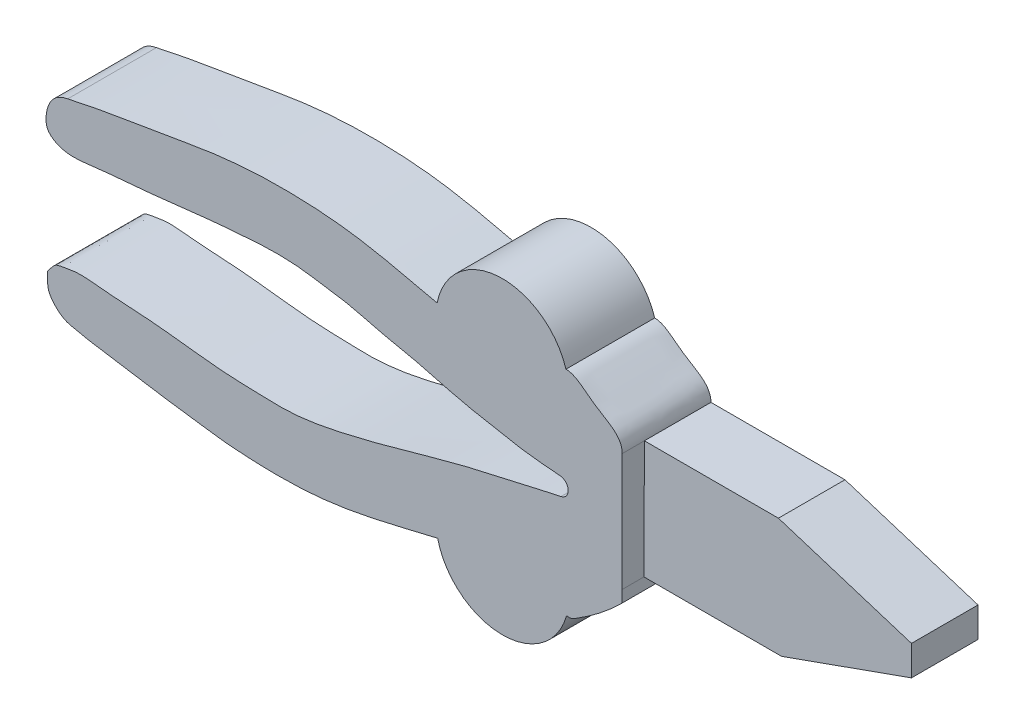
ISO-10303-21;
HEADER;
FILE_DESCRIPTION(('STEP AP214'),'2;1');
FILE_NAME('part.step','',(''),(''),'','','');
FILE_SCHEMA(('AUTOMOTIVE_DESIGN { 1 0 10303 214 1 1 1 1 }'));
ENDSEC;
DATA;
#1=APPLICATION_CONTEXT('core data for automotive mechanical design processes');
#2=APPLICATION_PROTOCOL_DEFINITION('international standard','automotive_design',2000,#1);
#3=PRODUCT_CONTEXT('',#1,'mechanical');
#4=PRODUCT('Part','Part','',(#3));
#5=PRODUCT_RELATED_PRODUCT_CATEGORY('part','',(#4));
#6=PRODUCT_DEFINITION_FORMATION('','',#4);
#7=PRODUCT_DEFINITION_CONTEXT('part definition',#1,'design');
#8=PRODUCT_DEFINITION('design','',#6,#7);
#9=PRODUCT_DEFINITION_SHAPE('','',#8);
#10=(LENGTH_UNIT() NAMED_UNIT(*) SI_UNIT(.MILLI.,.METRE.));
#11=(NAMED_UNIT(*) PLANE_ANGLE_UNIT() SI_UNIT($,.RADIAN.));
#12=(NAMED_UNIT(*) SI_UNIT($,.STERADIAN.) SOLID_ANGLE_UNIT());
#13=UNCERTAINTY_MEASURE_WITH_UNIT(LENGTH_MEASURE(1.E-05),#10,'distance_accuracy_value','');
#14=(GEOMETRIC_REPRESENTATION_CONTEXT(3) GLOBAL_UNCERTAINTY_ASSIGNED_CONTEXT((#13)) GLOBAL_UNIT_ASSIGNED_CONTEXT((#10,
#11,#12)) REPRESENTATION_CONTEXT('',''));
#15=CARTESIAN_POINT('',(0.,0.,0.));
#16=DIRECTION('',(0.,0.,1.));
#17=DIRECTION('',(1.,0.,0.));
#18=AXIS2_PLACEMENT_3D('',#15,#16,#17);
#19=CARTESIAN_POINT('',(148.195345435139,48.6152281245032,-10.));
#20=CARTESIAN_POINT('',(148.208099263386,51.8218800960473,-10.));
#21=CARTESIAN_POINT('',(143.613873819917,53.6701437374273,-10.));
#22=CARTESIAN_POINT('',(139.700909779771,56.8626115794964,-10.));
#23=CARTESIAN_POINT('',(137.365129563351,58.4830780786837,-10.));
#24=CARTESIAN_POINT('',(135.229107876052,58.9313212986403,-10.));
#25=CARTESIAN_POINT('',(133.229967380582,57.668449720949,-10.));
#26=CARTESIAN_POINT('',(131.066184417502,56.3201384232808,-10.));
#27=CARTESIAN_POINT('',(127.447413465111,55.0490551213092,-10.));
#28=CARTESIAN_POINT('',(123.710872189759,54.0091189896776,-10.));
#29=CARTESIAN_POINT('',(119.259709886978,54.4474365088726,-10.));
#30=CARTESIAN_POINT('',(114.88968035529,55.493518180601,-10.));
#31=CARTESIAN_POINT('',(108.007941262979,56.7323300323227,-10.));
#32=CARTESIAN_POINT('',(98.4048763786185,59.0840910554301,-10.));
#33=CARTESIAN_POINT('',(86.8819021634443,61.4287210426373,-10.));
#34=CARTESIAN_POINT('',(76.0003582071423,62.1829921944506,-10.));
#35=CARTESIAN_POINT('',(65.9021137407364,62.1347313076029,-10.));
#36=CARTESIAN_POINT('',(55.7867313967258,61.2560313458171,-10.));
#37=CARTESIAN_POINT('',(41.3713953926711,58.5466074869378,-10.));
#38=CARTESIAN_POINT('',(30.3864218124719,57.0132370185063,-10.));
#39=CARTESIAN_POINT('',(23.2076068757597,55.3686872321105,-10.));
#40=B_SPLINE_CURVE_WITH_KNOTS('',3,(#19,#20,#21,#22,#23,#24,#25,#26,#27,#28,#29,#30,#31,#32,#33,
#34,#35,#36,#37,#38,#39),.UNSPECIFIED.,.F.,.F.,(4,1,1,1,1,1,1,1,1,1,1,1,1,1,1,1,1,1,4),(0.,
0.0657344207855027,0.0956229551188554,0.117945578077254,0.130262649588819,0.142338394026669,
0.169682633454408,0.189239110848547,0.229570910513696,0.256902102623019,0.290240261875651,
0.332346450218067,0.416488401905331,0.516135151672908,0.600455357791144,0.665103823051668,
0.746721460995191,0.83194070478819,1.),.UNSPECIFIED.);
#41=DIRECTION('',(0.,0.,1.));
#42=VECTOR('',#41,1.);
#43=SURFACE_OF_LINEAR_EXTRUSION('',#40,#42);
#44=DIRECTION('',(0.,0.,1.));
#45=VECTOR('',#44,1.);
#46=CARTESIAN_POINT('',(135.515255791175,58.7513287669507,-10.));
#47=LINE('',#46,#45);
#48=CARTESIAN_POINT('',(135.515255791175,58.7513287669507,10.));
#49=VERTEX_POINT('',#48);
#50=CARTESIAN_POINT('',(135.515255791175,58.7513287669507,-10.));
#51=VERTEX_POINT('',#50);
#52=EDGE_CURVE('E173',#49,#51,#47,.F.);
#53=ORIENTED_EDGE('',*,*,#52,.F.);
#54=CARTESIAN_POINT('',(148.195345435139,48.6152281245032,10.));
#55=CARTESIAN_POINT('',(148.208099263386,51.8218800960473,10.));
#56=CARTESIAN_POINT('',(143.613873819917,53.6701437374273,10.));
#57=CARTESIAN_POINT('',(139.700909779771,56.8626115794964,10.));
#58=CARTESIAN_POINT('',(137.365129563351,58.4830780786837,10.));
#59=CARTESIAN_POINT('',(135.229107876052,58.9313212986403,10.));
#60=CARTESIAN_POINT('',(133.229967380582,57.668449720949,10.));
#61=CARTESIAN_POINT('',(131.066184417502,56.3201384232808,10.));
#62=CARTESIAN_POINT('',(127.447413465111,55.0490551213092,10.));
#63=CARTESIAN_POINT('',(123.710872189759,54.0091189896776,10.));
#64=CARTESIAN_POINT('',(119.259709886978,54.4474365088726,10.));
#65=CARTESIAN_POINT('',(114.88968035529,55.493518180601,10.));
#66=CARTESIAN_POINT('',(108.007941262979,56.7323300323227,10.));
#67=CARTESIAN_POINT('',(98.4048763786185,59.0840910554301,10.));
#68=CARTESIAN_POINT('',(86.8819021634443,61.4287210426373,10.));
#69=CARTESIAN_POINT('',(76.0003582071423,62.1829921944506,10.));
#70=CARTESIAN_POINT('',(65.9021137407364,62.1347313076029,10.));
#71=CARTESIAN_POINT('',(55.7867313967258,61.2560313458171,10.));
#72=CARTESIAN_POINT('',(41.3713953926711,58.5466074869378,10.));
#73=CARTESIAN_POINT('',(30.3864218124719,57.0132370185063,10.));
#74=CARTESIAN_POINT('',(23.2076068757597,55.3686872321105,10.));
#75=B_SPLINE_CURVE_WITH_KNOTS('',3,(#54,#55,#56,#57,#58,#59,#60,#61,#62,#63,#64,#65,#66,#67,#68,
#69,#70,#71,#72,#73,#74),.UNSPECIFIED.,.F.,.F.,(4,1,1,1,1,1,1,1,1,1,1,1,1,1,1,1,1,1,4),(0.,
0.0657344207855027,0.0956229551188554,0.117945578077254,0.130262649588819,0.142338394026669,
0.169682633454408,0.189239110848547,0.229570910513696,0.256902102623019,0.290240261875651,
0.332346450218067,0.416488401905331,0.516135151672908,0.600455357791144,0.665103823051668,
0.746721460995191,0.83194070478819,1.),.UNSPECIFIED.);
#76=CARTESIAN_POINT('',(148.195345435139,48.6152281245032,10.));
#77=VERTEX_POINT('',#76);
#78=EDGE_CURVE('E258',#77,#49,#75,.T.);
#79=ORIENTED_EDGE('',*,*,#78,.F.);
#80=DIRECTION('',(0.,0.,1.));
#81=VECTOR('',#80,1.);
#82=CARTESIAN_POINT('',(148.195345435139,48.6152281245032,5.));
#83=LINE('',#82,#81);
#84=CARTESIAN_POINT('',(148.195345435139,48.6152281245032,5.));
#85=VERTEX_POINT('',#84);
#86=EDGE_CURVE('E221',#85,#77,#83,.T.);
#87=ORIENTED_EDGE('',*,*,#86,.F.);
#88=DIRECTION('',(0.,0.,1.));
#89=VECTOR('',#88,1.);
#90=CARTESIAN_POINT('',(148.195345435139,48.6152281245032,-10.));
#91=LINE('',#90,#89);
#92=CARTESIAN_POINT('',(148.195345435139,48.6152281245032,-10.));
#93=VERTEX_POINT('',#92);
#94=EDGE_CURVE('E50',#93,#85,#91,.T.);
#95=ORIENTED_EDGE('',*,*,#94,.F.);
#96=EDGE_CURVE('E58',#93,#51,#40,.T.);
#97=ORIENTED_EDGE('',*,*,#96,.T.);
#98=EDGE_LOOP('',(#53,#79,#87,#95,#97));
#99=FACE_BOUND('',#98,.T.);
#100=ADVANCED_FACE('F39',(#99),#43,.T.);
#101=CARTESIAN_POINT('',(134.407607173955,33.3447882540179,-10.));
#102=CARTESIAN_POINT('',(131.644718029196,32.8087836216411,-10.));
#103=CARTESIAN_POINT('',(126.500486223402,31.4793658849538,-10.));
#104=CARTESIAN_POINT('',(118.049906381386,29.7139507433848,-10.));
#105=CARTESIAN_POINT('',(108.971990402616,27.5498509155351,-10.));
#106=CARTESIAN_POINT('',(97.4394139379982,24.1548739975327,-10.));
#107=CARTESIAN_POINT('',(87.0363899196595,21.4443502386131,-10.));
#108=CARTESIAN_POINT('',(77.6990482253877,19.6032159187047,-10.));
#109=CARTESIAN_POINT('',(71.7535503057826,19.0943836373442,-10.));
#110=CARTESIAN_POINT('',(66.0265473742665,19.3843612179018,-10.));
#111=CARTESIAN_POINT('',(59.7675105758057,19.4469588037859,-10.));
#112=CARTESIAN_POINT('',(51.5582553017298,20.3147571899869,-10.));
#113=CARTESIAN_POINT('',(41.2332280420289,21.5802661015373,-10.));
#114=CARTESIAN_POINT('',(32.3234853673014,21.8930058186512,-10.));
#115=CARTESIAN_POINT('',(25.7624721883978,22.7036119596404,-10.));
#116=CARTESIAN_POINT('',(22.7448533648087,22.0764125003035,-10.));
#117=CARTESIAN_POINT('',(20.3485088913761,21.7262292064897,-10.));
#118=CARTESIAN_POINT('',(19.4784128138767,20.4320097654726,-10.));
#119=CARTESIAN_POINT('',(18.5636630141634,19.5411649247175,-10.));
#120=CARTESIAN_POINT('',(18.7130474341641,18.4319491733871,-10.));
#121=CARTESIAN_POINT('',(18.6265511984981,17.2948881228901,-10.));
#122=CARTESIAN_POINT('',(18.8262308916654,15.6013268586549,-10.));
#123=CARTESIAN_POINT('',(20.2724280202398,13.4783561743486,-10.));
#124=CARTESIAN_POINT('',(22.3252473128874,11.8049278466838,-10.));
#125=CARTESIAN_POINT('',(25.0196434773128,11.2182360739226,-10.));
#126=CARTESIAN_POINT('',(27.5831451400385,10.649458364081,-10.));
#127=CARTESIAN_POINT('',(30.9472700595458,10.1650050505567,-10.));
#128=CARTESIAN_POINT('',(34.9080387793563,9.56181788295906,-10.));
#129=CARTESIAN_POINT('',(39.3533058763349,8.79734272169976,-10.));
#130=CARTESIAN_POINT('',(44.5272057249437,7.96126307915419,-10.));
#131=CARTESIAN_POINT('',(50.9727047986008,7.17013681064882,-10.));
#132=CARTESIAN_POINT('',(57.7517549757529,6.05951497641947,-10.));
#133=CARTESIAN_POINT('',(65.9335944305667,5.56194391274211,-10.));
#134=CARTESIAN_POINT('',(74.140878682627,5.41858042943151,-10.));
#135=CARTESIAN_POINT('',(85.8884282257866,6.4194690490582,-10.));
#136=CARTESIAN_POINT('',(97.9630106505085,9.21604355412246,-10.));
#137=CARTESIAN_POINT('',(109.313963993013,11.9348458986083,-10.));
#138=CARTESIAN_POINT('',(116.492274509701,13.7740621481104,-10.));
#139=CARTESIAN_POINT('',(121.116113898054,14.830979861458,-10.));
#140=CARTESIAN_POINT('',(125.162180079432,15.0182464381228,-10.));
#141=CARTESIAN_POINT('',(128.57908460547,13.9294856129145,-10.));
#142=CARTESIAN_POINT('',(131.857000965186,12.6499996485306,-10.));
#143=CARTESIAN_POINT('',(134.031385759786,11.0752586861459,-10.));
#144=CARTESIAN_POINT('',(136.535797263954,10.4176711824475,-10.));
#145=CARTESIAN_POINT('',(138.245004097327,11.5337016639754,-10.));
#146=CARTESIAN_POINT('',(142.241840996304,14.1368445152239,-10.));
#147=CARTESIAN_POINT('',(145.655062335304,16.8763186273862,-10.));
#148=CARTESIAN_POINT('',(148.092389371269,19.3431080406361,-10.));
#149=B_SPLINE_CURVE_WITH_KNOTS('',3,(#101,#102,#103,#104,#105,#106,#107,#108,#109,#110,#111,
#112,#113,#114,#115,#116,#117,#118,#119,#120,#121,#122,#123,#124,#125,#126,#127,#128,#129,#130,
#131,#132,#133,#134,#135,#136,#137,#138,#139,#140,#141,#142,#143,#144,#145,#146,#147,#148),
.UNSPECIFIED.,.F.,.F.,(4,1,1,1,1,1,1,1,1,1,1,1,1,1,1,1,1,1,1,1,1,1,1,1,1,1,1,1,1,1,1,1,1,1,1,1,
1,1,1,1,1,1,1,1,1,4),(0.0399755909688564,0.0713070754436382,0.0992250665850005,
0.136194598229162,0.175306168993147,0.23323337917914,0.255959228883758,0.28135673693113,
0.299480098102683,0.319845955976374,0.351100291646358,0.391447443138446,0.435595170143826,
0.451025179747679,0.464050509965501,0.470512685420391,0.476394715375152,0.480932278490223,
0.48362881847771,0.488248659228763,0.493852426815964,0.502141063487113,0.516248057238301,
0.52199309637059,0.532673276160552,0.545582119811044,0.559835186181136,0.577350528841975,
0.595860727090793,0.618253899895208,0.649744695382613,0.672360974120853,0.709566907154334,
0.741168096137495,0.803525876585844,0.847391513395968,0.871365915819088,0.886107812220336,
0.900290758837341,0.91581910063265,0.925679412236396,0.939304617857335,0.945950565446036,
0.952609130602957,0.96079100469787,1.),.UNSPECIFIED.);
#150=DIRECTION('',(0.,0.,1.));
#151=VECTOR('',#150,1.);
#152=SURFACE_OF_LINEAR_EXTRUSION('',#149,#151);
#153=DIRECTION('',(0.,0.,1.));
#154=VECTOR('',#153,1.);
#155=CARTESIAN_POINT('',(106.592972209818,11.2932727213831,-10.));
#156=LINE('',#155,#154);
#157=CARTESIAN_POINT('',(106.592972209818,11.2932727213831,10.));
#158=VERTEX_POINT('',#157);
#159=CARTESIAN_POINT('',(106.592972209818,11.2932727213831,-10.));
#160=VERTEX_POINT('',#159);
#161=EDGE_CURVE('E196',#158,#160,#156,.F.);
#162=ORIENTED_EDGE('',*,*,#161,.F.);
#163=CARTESIAN_POINT('',(134.407607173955,33.3447882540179,10.));
#164=CARTESIAN_POINT('',(131.644718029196,32.8087836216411,10.));
#165=CARTESIAN_POINT('',(126.500486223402,31.4793658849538,10.));
#166=CARTESIAN_POINT('',(118.049906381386,29.7139507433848,10.));
#167=CARTESIAN_POINT('',(108.971990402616,27.5498509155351,10.));
#168=CARTESIAN_POINT('',(97.4394139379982,24.1548739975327,10.));
#169=CARTESIAN_POINT('',(87.0363899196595,21.4443502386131,10.));
#170=CARTESIAN_POINT('',(77.6990482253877,19.6032159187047,10.));
#171=CARTESIAN_POINT('',(71.7535503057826,19.0943836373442,10.));
#172=CARTESIAN_POINT('',(66.0265473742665,19.3843612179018,10.));
#173=CARTESIAN_POINT('',(59.7675105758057,19.4469588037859,10.));
#174=CARTESIAN_POINT('',(51.5582553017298,20.3147571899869,10.));
#175=CARTESIAN_POINT('',(41.2332280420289,21.5802661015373,10.));
#176=CARTESIAN_POINT('',(32.3234853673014,21.8930058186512,10.));
#177=CARTESIAN_POINT('',(25.7624721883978,22.7036119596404,10.));
#178=CARTESIAN_POINT('',(22.7448533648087,22.0764125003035,10.));
#179=CARTESIAN_POINT('',(20.3485088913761,21.7262292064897,10.));
#180=CARTESIAN_POINT('',(19.4784128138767,20.4320097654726,10.));
#181=CARTESIAN_POINT('',(18.5636630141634,19.5411649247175,10.));
#182=CARTESIAN_POINT('',(18.7130474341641,18.4319491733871,10.));
#183=CARTESIAN_POINT('',(18.6265511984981,17.2948881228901,10.));
#184=CARTESIAN_POINT('',(18.8262308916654,15.6013268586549,10.));
#185=CARTESIAN_POINT('',(20.2724280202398,13.4783561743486,10.));
#186=CARTESIAN_POINT('',(22.3252473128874,11.8049278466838,10.));
#187=CARTESIAN_POINT('',(25.0196434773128,11.2182360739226,10.));
#188=CARTESIAN_POINT('',(27.5831451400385,10.649458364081,10.));
#189=CARTESIAN_POINT('',(30.9472700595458,10.1650050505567,10.));
#190=CARTESIAN_POINT('',(34.9080387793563,9.56181788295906,10.));
#191=CARTESIAN_POINT('',(39.3533058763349,8.79734272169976,10.));
#192=CARTESIAN_POINT('',(44.5272057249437,7.96126307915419,10.));
#193=CARTESIAN_POINT('',(50.9727047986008,7.17013681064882,10.));
#194=CARTESIAN_POINT('',(57.7517549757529,6.05951497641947,10.));
#195=CARTESIAN_POINT('',(65.9335944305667,5.56194391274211,10.));
#196=CARTESIAN_POINT('',(74.140878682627,5.41858042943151,10.));
#197=CARTESIAN_POINT('',(85.8884282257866,6.4194690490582,10.));
#198=CARTESIAN_POINT('',(97.9630106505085,9.21604355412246,10.));
#199=CARTESIAN_POINT('',(109.313963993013,11.9348458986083,10.));
#200=CARTESIAN_POINT('',(116.492274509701,13.7740621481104,10.));
#201=CARTESIAN_POINT('',(121.116113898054,14.830979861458,10.));
#202=CARTESIAN_POINT('',(125.162180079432,15.0182464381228,10.));
#203=CARTESIAN_POINT('',(128.57908460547,13.9294856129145,10.));
#204=CARTESIAN_POINT('',(131.857000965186,12.6499996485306,10.));
#205=CARTESIAN_POINT('',(134.031385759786,11.0752586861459,10.));
#206=CARTESIAN_POINT('',(136.535797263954,10.4176711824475,10.));
#207=CARTESIAN_POINT('',(138.245004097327,11.5337016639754,10.));
#208=CARTESIAN_POINT('',(142.241840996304,14.1368445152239,10.));
#209=CARTESIAN_POINT('',(145.655062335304,16.8763186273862,10.));
#210=CARTESIAN_POINT('',(148.092389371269,19.3431080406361,10.));
#211=B_SPLINE_CURVE_WITH_KNOTS('',3,(#163,#164,#165,#166,#167,#168,#169,#170,#171,#172,#173,
#174,#175,#176,#177,#178,#179,#180,#181,#182,#183,#184,#185,#186,#187,#188,#189,#190,#191,#192,
#193,#194,#195,#196,#197,#198,#199,#200,#201,#202,#203,#204,#205,#206,#207,#208,#209,#210),
.UNSPECIFIED.,.F.,.F.,(4,1,1,1,1,1,1,1,1,1,1,1,1,1,1,1,1,1,1,1,1,1,1,1,1,1,1,1,1,1,1,1,1,1,1,1,
1,1,1,1,1,1,1,1,1,4),(0.0399755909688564,0.0713070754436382,0.0992250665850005,
0.136194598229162,0.175306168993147,0.23323337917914,0.255959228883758,0.28135673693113,
0.299480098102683,0.319845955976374,0.351100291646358,0.391447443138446,0.435595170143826,
0.451025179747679,0.464050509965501,0.470512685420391,0.476394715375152,0.480932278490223,
0.48362881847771,0.488248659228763,0.493852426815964,0.502141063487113,0.516248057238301,
0.52199309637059,0.532673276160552,0.545582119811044,0.559835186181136,0.577350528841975,
0.595860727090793,0.618253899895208,0.649744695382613,0.672360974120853,0.709566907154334,
0.741168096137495,0.803525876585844,0.847391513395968,0.871365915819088,0.886107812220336,
0.900290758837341,0.91581910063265,0.925679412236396,0.939304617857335,0.945950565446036,
0.952609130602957,0.96079100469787,1.),.UNSPECIFIED.);
#212=CARTESIAN_POINT('',(134.407607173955,33.3447882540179,10.));
#213=VERTEX_POINT('',#212);
#214=EDGE_CURVE('E245',#213,#158,#211,.T.);
#215=ORIENTED_EDGE('',*,*,#214,.F.);
#216=DIRECTION('',(0.,0.,1.));
#217=VECTOR('',#216,1.);
#218=CARTESIAN_POINT('',(134.407607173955,33.3447882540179,-10.));
#219=LINE('',#218,#217);
#220=CARTESIAN_POINT('',(134.407607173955,33.3447882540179,-10.));
#221=VERTEX_POINT('',#220);
#222=EDGE_CURVE('E400',#221,#213,#219,.T.);
#223=ORIENTED_EDGE('',*,*,#222,.F.);
#224=EDGE_CURVE('E301',#221,#160,#149,.T.);
#225=ORIENTED_EDGE('',*,*,#224,.T.);
#226=EDGE_LOOP('',(#162,#215,#223,#225));
#227=FACE_BOUND('',#226,.T.);
#228=ADVANCED_FACE('F299',(#227),#152,.T.);
#229=CARTESIAN_POINT('',(148.195345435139,48.6152281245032,-10.));
#230=DIRECTION('',(0.,1.,0.));
#231=DIRECTION('',(0.,0.,1.));
#232=AXIS2_PLACEMENT_3D('',#229,#230,#231);
#233=PLANE('',#232);
#234=ORIENTED_EDGE('',*,*,#94,.T.);
#235=DIRECTION('',(-1.,0.,0.));
#236=VECTOR('',#235,1.);
#237=CARTESIAN_POINT('',(178.406074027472,48.6152281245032,5.));
#238=LINE('',#237,#236);
#239=CARTESIAN_POINT('',(178.406074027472,48.6152281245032,5.));
#240=VERTEX_POINT('',#239);
#241=EDGE_CURVE('E214',#240,#85,#238,.T.);
#242=ORIENTED_EDGE('',*,*,#241,.F.);
#243=DIRECTION('',(0.,0.,1.));
#244=VECTOR('',#243,1.);
#245=CARTESIAN_POINT('',(178.406074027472,48.6152281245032,-10.));
#246=LINE('',#245,#244);
#247=CARTESIAN_POINT('',(178.406074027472,48.6152281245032,-10.));
#248=VERTEX_POINT('',#247);
#249=EDGE_CURVE('E414',#248,#240,#246,.T.);
#250=ORIENTED_EDGE('',*,*,#249,.F.);
#251=DIRECTION('',(-1.,0.,0.));
#252=VECTOR('',#251,1.);
#253=CARTESIAN_POINT('',(148.195345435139,48.6152281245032,-10.));
#254=LINE('',#253,#252);
#255=EDGE_CURVE('E165',#248,#93,#254,.T.);
#256=ORIENTED_EDGE('',*,*,#255,.T.);
#257=EDGE_LOOP('',(#234,#242,#250,#256));
#258=FACE_BOUND('',#257,.T.);
#259=ADVANCED_FACE('F347',(#258),#233,.T.);
#260=CARTESIAN_POINT('',(178.406074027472,48.6152281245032,-10.));
#261=DIRECTION('',(0.300535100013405,0.953770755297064,0.));
#262=DIRECTION('',(-0.953770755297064,0.300535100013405,0.));
#263=AXIS2_PLACEMENT_3D('',#260,#261,#262);
#264=PLANE('',#263);
#265=ORIENTED_EDGE('',*,*,#249,.T.);
#266=DIRECTION('',(-0.953770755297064,0.300535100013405,0.));
#267=VECTOR('',#266,1.);
#268=CARTESIAN_POINT('',(208.388071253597,39.1678399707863,5.));
#269=LINE('',#268,#267);
#270=CARTESIAN_POINT('',(208.388071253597,39.1678399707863,5.));
#271=VERTEX_POINT('',#270);
#272=EDGE_CURVE('E211',#271,#240,#269,.T.);
#273=ORIENTED_EDGE('',*,*,#272,.F.);
#274=DIRECTION('',(0.,0.,1.));
#275=VECTOR('',#274,1.);
#276=CARTESIAN_POINT('',(208.388071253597,39.1678399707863,-10.));
#277=LINE('',#276,#275);
#278=CARTESIAN_POINT('',(208.388071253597,39.1678399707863,-10.));
#279=VERTEX_POINT('',#278);
#280=EDGE_CURVE('E421',#279,#271,#277,.T.);
#281=ORIENTED_EDGE('',*,*,#280,.F.);
#282=DIRECTION('',(-0.953770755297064,0.300535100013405,0.));
#283=VECTOR('',#282,1.);
#284=CARTESIAN_POINT('',(178.406074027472,48.6152281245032,-10.));
#285=LINE('',#284,#283);
#286=EDGE_CURVE('E327',#279,#248,#285,.T.);
#287=ORIENTED_EDGE('',*,*,#286,.T.);
#288=EDGE_LOOP('',(#265,#273,#281,#287));
#289=FACE_BOUND('',#288,.T.);
#290=ADVANCED_FACE('F350',(#289),#264,.T.);
#291=CARTESIAN_POINT('',(208.388071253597,39.1678399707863,-10.));
#292=DIRECTION('',(1.,0.,0.));
#293=DIRECTION('',(0.,0.,-1.));
#294=AXIS2_PLACEMENT_3D('',#291,#292,#293);
#295=PLANE('',#294);
#296=ORIENTED_EDGE('',*,*,#280,.T.);
#297=DIRECTION('',(0.,1.,0.));
#298=VECTOR('',#297,1.);
#299=CARTESIAN_POINT('',(208.388071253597,32.4233435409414,5.));
#300=LINE('',#299,#298);
#301=CARTESIAN_POINT('',(208.388071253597,32.4233435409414,5.));
#302=VERTEX_POINT('',#301);
#303=EDGE_CURVE('E208',#302,#271,#300,.T.);
#304=ORIENTED_EDGE('',*,*,#303,.F.);
#305=DIRECTION('',(0.,0.,1.));
#306=VECTOR('',#305,1.);
#307=CARTESIAN_POINT('',(208.388071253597,32.4233435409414,-10.));
#308=LINE('',#307,#306);
#309=CARTESIAN_POINT('',(208.388071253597,32.4233435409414,-10.));
#310=VERTEX_POINT('',#309);
#311=EDGE_CURVE('E397',#310,#302,#308,.T.);
#312=ORIENTED_EDGE('',*,*,#311,.F.);
#313=DIRECTION('',(0.,1.,0.));
#314=VECTOR('',#313,1.);
#315=CARTESIAN_POINT('',(208.388071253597,39.1678399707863,-10.));
#316=LINE('',#315,#314);
#317=EDGE_CURVE('E323',#310,#279,#316,.T.);
#318=ORIENTED_EDGE('',*,*,#317,.T.);
#319=EDGE_LOOP('',(#296,#304,#312,#318));
#320=FACE_BOUND('',#319,.T.);
#321=ADVANCED_FACE('F354',(#320),#295,.T.);
#322=CARTESIAN_POINT('',(208.388071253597,32.4233435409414,-10.));
#323=DIRECTION('',(0.335366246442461,-0.942087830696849,0.));
#324=DIRECTION('',(0.942087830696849,0.335366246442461,0.));
#325=AXIS2_PLACEMENT_3D('',#322,#323,#324);
#326=PLANE('',#325);
#327=ORIENTED_EDGE('',*,*,#311,.T.);
#328=DIRECTION('',(0.942087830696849,0.335366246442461,0.));
#329=VECTOR('',#328,1.);
#330=CARTESIAN_POINT('',(179.0927308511,21.9947316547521,5.));
#331=LINE('',#330,#329);
#332=CARTESIAN_POINT('',(179.0927308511,21.9947316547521,5.));
#333=VERTEX_POINT('',#332);
#334=EDGE_CURVE('E204',#333,#302,#331,.T.);
#335=ORIENTED_EDGE('',*,*,#334,.F.);
#336=DIRECTION('',(0.,0.,1.));
#337=VECTOR('',#336,1.);
#338=CARTESIAN_POINT('',(179.0927308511,21.9947316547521,-10.));
#339=LINE('',#338,#337);
#340=CARTESIAN_POINT('',(179.0927308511,21.9947316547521,-10.));
#341=VERTEX_POINT('',#340);
#342=EDGE_CURVE('E392',#341,#333,#339,.T.);
#343=ORIENTED_EDGE('',*,*,#342,.F.);
#344=DIRECTION('',(0.942087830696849,0.335366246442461,0.));
#345=VECTOR('',#344,1.);
#346=CARTESIAN_POINT('',(208.388071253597,32.4233435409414,-10.));
#347=LINE('',#346,#345);
#348=EDGE_CURVE('E319',#341,#310,#347,.T.);
#349=ORIENTED_EDGE('',*,*,#348,.T.);
#350=EDGE_LOOP('',(#327,#335,#343,#349));
#351=FACE_BOUND('',#350,.T.);
#352=ADVANCED_FACE('F358',(#351),#326,.T.);
#353=CARTESIAN_POINT('',(179.0927308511,21.9947316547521,-10.));
#354=DIRECTION('',(0.,-1.,0.));
#355=DIRECTION('',(0.,0.,-1.));
#356=AXIS2_PLACEMENT_3D('',#353,#354,#355);
#357=PLANE('',#356);
#358=ORIENTED_EDGE('',*,*,#342,.T.);
#359=DIRECTION('',(1.,0.,0.));
#360=VECTOR('',#359,1.);
#361=CARTESIAN_POINT('',(148.092389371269,21.9947316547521,5.));
#362=LINE('',#361,#360);
#363=CARTESIAN_POINT('',(148.092389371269,21.9947316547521,5.));
#364=VERTEX_POINT('',#363);
#365=EDGE_CURVE('E201',#364,#333,#362,.T.);
#366=ORIENTED_EDGE('',*,*,#365,.F.);
#367=DIRECTION('',(0.,0.,1.));
#368=VECTOR('',#367,1.);
#369=CARTESIAN_POINT('',(148.092389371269,21.9947316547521,-10.));
#370=LINE('',#369,#368);
#371=CARTESIAN_POINT('',(148.092389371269,21.9947316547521,-10.));
#372=VERTEX_POINT('',#371);
#373=EDGE_CURVE('E387',#372,#364,#370,.T.);
#374=ORIENTED_EDGE('',*,*,#373,.F.);
#375=DIRECTION('',(1.,0.,0.));
#376=VECTOR('',#375,1.);
#377=CARTESIAN_POINT('',(179.0927308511,21.9947316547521,-10.));
#378=LINE('',#377,#376);
#379=EDGE_CURVE('E315',#372,#341,#378,.T.);
#380=ORIENTED_EDGE('',*,*,#379,.T.);
#381=EDGE_LOOP('',(#358,#366,#374,#380));
#382=FACE_BOUND('',#381,.T.);
#383=ADVANCED_FACE('F361',(#382),#357,.T.);
#384=CARTESIAN_POINT('',(23.2076068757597,55.3686872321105,-10.));
#385=CARTESIAN_POINT('',(20.0415483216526,54.7924485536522,-10.));
#386=CARTESIAN_POINT('',(18.2617563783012,51.7875839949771,-10.));
#387=CARTESIAN_POINT('',(18.2550151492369,47.033685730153,-10.));
#388=CARTESIAN_POINT('',(21.0492743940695,44.9733651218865,-10.));
#389=CARTESIAN_POINT('',(24.5689282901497,44.4756851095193,-10.));
#390=CARTESIAN_POINT('',(29.3446664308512,45.1186839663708,-10.));
#391=CARTESIAN_POINT('',(35.1005820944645,45.6866720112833,-10.));
#392=CARTESIAN_POINT('',(45.4945688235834,46.5066096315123,-10.));
#393=CARTESIAN_POINT('',(53.613865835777,47.6746765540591,-10.));
#394=CARTESIAN_POINT('',(59.506261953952,48.1512462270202,-10.));
#395=B_SPLINE_CURVE_WITH_KNOTS('',3,(#384,#385,#386,#387,#388,#389,#390,#391,#392,#393,#394),
.UNSPECIFIED.,.F.,.F.,(4,1,1,1,1,1,1,1,4),(0.,0.145165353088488,0.198688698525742,
0.251789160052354,0.326547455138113,0.400122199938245,0.528133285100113,0.659838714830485,1.),.UNSPECIFIED.);
#396=DIRECTION('',(0.,0.,1.));
#397=VECTOR('',#396,1.);
#398=SURFACE_OF_LINEAR_EXTRUSION('',#395,#397);
#399=DIRECTION('',(0.,0.,1.));
#400=VECTOR('',#399,1.);
#401=CARTESIAN_POINT('',(59.506261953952,48.1512462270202,-10.));
#402=LINE('',#401,#400);
#403=CARTESIAN_POINT('',(59.506261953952,48.1512462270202,-10.));
#404=VERTEX_POINT('',#403);
#405=CARTESIAN_POINT('',(59.506261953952,48.1512462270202,10.));
#406=VERTEX_POINT('',#405);
#407=EDGE_CURVE('E337',#404,#406,#402,.T.);
#408=ORIENTED_EDGE('',*,*,#407,.T.);
#409=CARTESIAN_POINT('',(23.2076068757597,55.3686872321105,10.));
#410=CARTESIAN_POINT('',(20.0415483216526,54.7924485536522,10.));
#411=CARTESIAN_POINT('',(18.2617563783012,51.7875839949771,10.));
#412=CARTESIAN_POINT('',(18.2550151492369,47.033685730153,10.));
#413=CARTESIAN_POINT('',(21.0492743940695,44.9733651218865,10.));
#414=CARTESIAN_POINT('',(24.5689282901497,44.4756851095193,10.));
#415=CARTESIAN_POINT('',(29.3446664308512,45.1186839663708,10.));
#416=CARTESIAN_POINT('',(35.1005820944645,45.6866720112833,10.));
#417=CARTESIAN_POINT('',(45.4945688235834,46.5066096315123,10.));
#418=CARTESIAN_POINT('',(53.613865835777,47.6746765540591,10.));
#419=CARTESIAN_POINT('',(59.506261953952,48.1512462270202,10.));
#420=B_SPLINE_CURVE_WITH_KNOTS('',3,(#409,#410,#411,#412,#413,#414,#415,#416,#417,#418,#419),
.UNSPECIFIED.,.F.,.F.,(4,1,1,1,1,1,1,1,4),(0.,0.145165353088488,0.198688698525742,
0.251789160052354,0.326547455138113,0.400122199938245,0.528133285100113,0.659838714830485,1.),.UNSPECIFIED.);
#421=CARTESIAN_POINT('',(23.2076068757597,55.3686872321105,10.));
#422=VERTEX_POINT('',#421);
#423=EDGE_CURVE('E222',#422,#406,#420,.T.);
#424=ORIENTED_EDGE('',*,*,#423,.F.);
#425=DIRECTION('',(0.,0.,1.));
#426=VECTOR('',#425,1.);
#427=CARTESIAN_POINT('',(23.2076068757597,55.3686872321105,-10.));
#428=LINE('',#427,#426);
#429=CARTESIAN_POINT('',(23.2076068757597,55.3686872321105,-10.));
#430=VERTEX_POINT('',#429);
#431=EDGE_CURVE('E11',#430,#422,#428,.T.);
#432=ORIENTED_EDGE('',*,*,#431,.F.);
#433=EDGE_CURVE('E162',#430,#404,#395,.T.);
#434=ORIENTED_EDGE('',*,*,#433,.T.);
#435=EDGE_LOOP('',(#408,#424,#432,#434));
#436=FACE_BOUND('',#435,.T.);
#437=ADVANCED_FACE('F41',(#436),#398,.T.);
#438=DIRECTION('',(0.,0.,1.));
#439=VECTOR('',#438,1.);
#440=CARTESIAN_POINT('',(106.472810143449,57.1576384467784,-10.));
#441=LINE('',#440,#439);
#442=CARTESIAN_POINT('',(106.472810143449,57.1576384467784,-10.));
#443=VERTEX_POINT('',#442);
#444=CARTESIAN_POINT('',(106.472810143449,57.1576384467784,10.));
#445=VERTEX_POINT('',#444);
#446=EDGE_CURVE('E167',#443,#445,#441,.T.);
#447=ORIENTED_EDGE('',*,*,#446,.F.);
#448=EDGE_CURVE('E156',#443,#430,#40,.T.);
#449=ORIENTED_EDGE('',*,*,#448,.T.);
#450=ORIENTED_EDGE('',*,*,#431,.T.);
#451=EDGE_CURVE('E65',#445,#422,#75,.T.);
#452=ORIENTED_EDGE('',*,*,#451,.F.);
#453=EDGE_LOOP('',(#447,#449,#450,#452));
#454=FACE_BOUND('',#453,.T.);
#455=ADVANCED_FACE('F168',(#454),#43,.T.);
#456=CARTESIAN_POINT('',(148.092389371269,21.9947316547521,-10.));
#457=DIRECTION('',(1.,0.,0.));
#458=DIRECTION('',(0.,0.,-1.));
#459=AXIS2_PLACEMENT_3D('',#456,#457,#458);
#460=PLANE('',#459);
#461=ORIENTED_EDGE('',*,*,#373,.T.);
#462=DIRECTION('',(0.,0.,1.));
#463=VECTOR('',#462,1.);
#464=CARTESIAN_POINT('',(148.092389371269,21.9947316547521,5.));
#465=LINE('',#464,#463);
#466=CARTESIAN_POINT('',(148.092389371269,21.9947316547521,10.));
#467=VERTEX_POINT('',#466);
#468=EDGE_CURVE('E217',#364,#467,#465,.T.);
#469=ORIENTED_EDGE('',*,*,#468,.T.);
#470=DIRECTION('',(0.,1.,0.));
#471=VECTOR('',#470,1.);
#472=CARTESIAN_POINT('',(148.092389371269,21.9947316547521,10.));
#473=LINE('',#472,#471);
#474=CARTESIAN_POINT('',(148.092389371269,19.3431080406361,10.));
#475=VERTEX_POINT('',#474);
#476=EDGE_CURVE('E251',#475,#467,#473,.T.);
#477=ORIENTED_EDGE('',*,*,#476,.F.);
#478=DIRECTION('',(0.,0.,1.));
#479=VECTOR('',#478,1.);
#480=CARTESIAN_POINT('',(148.092389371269,19.3431080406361,-10.));
#481=LINE('',#480,#479);
#482=CARTESIAN_POINT('',(148.092389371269,19.3431080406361,-10.));
#483=VERTEX_POINT('',#482);
#484=EDGE_CURVE('E393',#483,#475,#481,.T.);
#485=ORIENTED_EDGE('',*,*,#484,.F.);
#486=DIRECTION('',(0.,1.,0.));
#487=VECTOR('',#486,1.);
#488=CARTESIAN_POINT('',(148.092389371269,21.9947316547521,-10.));
#489=LINE('',#488,#487);
#490=EDGE_CURVE('E307',#483,#372,#489,.T.);
#491=ORIENTED_EDGE('',*,*,#490,.T.);
#492=EDGE_LOOP('',(#461,#469,#477,#485,#491));
#493=FACE_BOUND('',#492,.T.);
#494=ADVANCED_FACE('F297',(#493),#460,.T.);
#495=DIRECTION('',(0.,0.,1.));
#496=VECTOR('',#495,1.);
#497=CARTESIAN_POINT('',(135.643795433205,10.6939447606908,-10.));
#498=LINE('',#497,#496);
#499=CARTESIAN_POINT('',(135.643795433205,10.6939447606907,-10.));
#500=VERTEX_POINT('',#499);
#501=CARTESIAN_POINT('',(135.643795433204,10.6939447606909,10.));
#502=VERTEX_POINT('',#501);
#503=EDGE_CURVE('E189',#500,#502,#498,.T.);
#504=ORIENTED_EDGE('',*,*,#503,.F.);
#505=EDGE_CURVE('E308',#500,#483,#149,.T.);
#506=ORIENTED_EDGE('',*,*,#505,.T.);
#507=ORIENTED_EDGE('',*,*,#484,.T.);
#508=EDGE_CURVE('E244',#502,#475,#211,.T.);
#509=ORIENTED_EDGE('',*,*,#508,.F.);
#510=EDGE_LOOP('',(#504,#506,#507,#509));
#511=FACE_BOUND('',#510,.T.);
#512=ADVANCED_FACE('F293',(#511),#152,.T.);
#513=CARTESIAN_POINT('',(134.026705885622,35.308181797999,-10.));
#514=DIRECTION('',(0.,0.,1.));
#515=DIRECTION('',(1.,0.,0.));
#516=AXIS2_PLACEMENT_3D('',#513,#514,#515);
#517=CYLINDRICAL_SURFACE('',#516,2.);
#518=ORIENTED_EDGE('',*,*,#222,.T.);
#519=CARTESIAN_POINT('',(134.026705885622,35.308181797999,10.));
#520=DIRECTION('',(0.,0.,-1.));
#521=DIRECTION('',(1.,0.,0.));
#522=AXIS2_PLACEMENT_3D('',#519,#520,#521);
#523=CIRCLE('',#522,2.);
#524=CARTESIAN_POINT('',(134.092722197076,37.3070919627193,10.));
#525=VERTEX_POINT('',#524);
#526=EDGE_CURVE('E237',#525,#213,#523,.T.);
#527=ORIENTED_EDGE('',*,*,#526,.F.);
#528=DIRECTION('',(0.,0.,1.));
#529=VECTOR('',#528,1.);
#530=CARTESIAN_POINT('',(134.092722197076,37.3070919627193,-10.));
#531=LINE('',#530,#529);
#532=CARTESIAN_POINT('',(134.092722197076,37.3070919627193,-10.));
#533=VERTEX_POINT('',#532);
#534=EDGE_CURVE('E406',#533,#525,#531,.T.);
#535=ORIENTED_EDGE('',*,*,#534,.F.);
#536=CARTESIAN_POINT('',(134.026705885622,35.308181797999,-10.));
#537=DIRECTION('',(0.,0.,-1.));
#538=DIRECTION('',(1.,0.,0.));
#539=AXIS2_PLACEMENT_3D('',#536,#537,#538);
#540=CIRCLE('',#539,2.);
#541=EDGE_CURVE('E281',#533,#221,#540,.T.);
#542=ORIENTED_EDGE('',*,*,#541,.T.);
#543=EDGE_LOOP('',(#518,#527,#535,#542));
#544=FACE_BOUND('',#543,.T.);
#545=ADVANCED_FACE('F289',(#544),#517,.F.);
#546=CARTESIAN_POINT('',(59.506261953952,48.1512462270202,-10.));
#547=CARTESIAN_POINT('',(64.9290429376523,48.6014450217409,-10.));
#548=CARTESIAN_POINT('',(72.0805488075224,49.209492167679,-10.));
#549=CARTESIAN_POINT('',(81.0954937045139,47.7290524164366,-10.));
#550=CARTESIAN_POINT('',(86.6779242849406,47.005276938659,-10.));
#551=CARTESIAN_POINT('',(93.4975799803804,45.0370689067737,-10.));
#552=CARTESIAN_POINT('',(102.482234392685,43.4315660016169,-10.));
#553=CARTESIAN_POINT('',(112.075012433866,40.477178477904,-10.));
#554=CARTESIAN_POINT('',(124.157133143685,38.5509430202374,-10.));
#555=CARTESIAN_POINT('',(124.630728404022,38.2139011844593,-10.));
#556=CARTESIAN_POINT('',(133.063047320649,37.3410981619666,-10.));
#557=CARTESIAN_POINT('',(134.092722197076,37.3070919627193,-10.));
#558=B_SPLINE_CURVE_WITH_KNOTS('',3,(#546,#547,#548,#549,#550,#551,#552,#553,#554,#555,#556,
#557),.UNSPECIFIED.,.F.,.F.,(4,1,1,1,1,1,1,1,1,4),(0.127697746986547,0.317111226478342,
0.37139112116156,0.443085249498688,0.511076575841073,0.616787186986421,0.753467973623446,
0.879858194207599,0.964426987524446,1.),.UNSPECIFIED.);
#559=DIRECTION('',(0.,0.,1.));
#560=VECTOR('',#559,1.);
#561=SURFACE_OF_LINEAR_EXTRUSION('',#558,#560);
#562=ORIENTED_EDGE('',*,*,#534,.T.);
#563=CARTESIAN_POINT('',(59.506261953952,48.1512462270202,10.));
#564=CARTESIAN_POINT('',(64.9290429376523,48.6014450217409,10.));
#565=CARTESIAN_POINT('',(72.0805488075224,49.209492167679,10.));
#566=CARTESIAN_POINT('',(81.0954937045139,47.7290524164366,10.));
#567=CARTESIAN_POINT('',(86.6779242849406,47.005276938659,10.));
#568=CARTESIAN_POINT('',(93.4975799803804,45.0370689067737,10.));
#569=CARTESIAN_POINT('',(102.482234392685,43.4315660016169,10.));
#570=CARTESIAN_POINT('',(112.075012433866,40.477178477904,10.));
#571=CARTESIAN_POINT('',(124.157133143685,38.5509430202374,10.));
#572=CARTESIAN_POINT('',(124.630728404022,38.2139011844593,10.));
#573=CARTESIAN_POINT('',(133.063047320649,37.3410981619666,10.));
#574=CARTESIAN_POINT('',(134.092722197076,37.3070919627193,10.));
#575=B_SPLINE_CURVE_WITH_KNOTS('',3,(#563,#564,#565,#566,#567,#568,#569,#570,#571,#572,#573,
#574),.UNSPECIFIED.,.F.,.F.,(4,1,1,1,1,1,1,1,1,4),(0.127697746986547,0.317111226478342,
0.37139112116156,0.443085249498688,0.511076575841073,0.616787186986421,0.753467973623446,
0.879858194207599,0.964426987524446,1.),.UNSPECIFIED.);
#576=EDGE_CURVE('E228',#406,#525,#575,.T.);
#577=ORIENTED_EDGE('',*,*,#576,.F.);
#578=ORIENTED_EDGE('',*,*,#407,.F.);
#579=EDGE_CURVE('E271',#404,#533,#558,.T.);
#580=ORIENTED_EDGE('',*,*,#579,.T.);
#581=EDGE_LOOP('',(#562,#577,#578,#580));
#582=FACE_BOUND('',#581,.T.);
#583=ADVANCED_FACE('F286',(#582),#561,.T.);
#584=CARTESIAN_POINT('',(33.5808970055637,45.525897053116,-10.));
#585=DIRECTION('',(0.,0.,-1.));
#586=DIRECTION('',(-1.,0.,0.));
#587=AXIS2_PLACEMENT_3D('',#584,#585,#586);
#588=PLANE('',#587);
#589=ORIENTED_EDGE('',*,*,#448,.F.);
#590=CARTESIAN_POINT('',(121.195345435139,54.2858873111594,-10.));
#591=DIRECTION('',(0.,0.,-1.));
#592=DIRECTION('',(-1.,0.,0.));
#593=AXIS2_PLACEMENT_3D('',#590,#591,#592);
#594=CIRCLE('',#593,15.);
#595=EDGE_CURVE('E159',#443,#51,#594,.T.);
#596=ORIENTED_EDGE('',*,*,#595,.T.);
#597=ORIENTED_EDGE('',*,*,#96,.F.);
#598=ORIENTED_EDGE('',*,*,#255,.F.);
#599=ORIENTED_EDGE('',*,*,#286,.F.);
#600=ORIENTED_EDGE('',*,*,#317,.F.);
#601=ORIENTED_EDGE('',*,*,#348,.F.);
#602=ORIENTED_EDGE('',*,*,#379,.F.);
#603=ORIENTED_EDGE('',*,*,#490,.F.);
#604=ORIENTED_EDGE('',*,*,#505,.F.);
#605=CARTESIAN_POINT('',(121.195345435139,14.7241175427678,-10.));
#606=DIRECTION('',(0.,0.,-1.));
#607=DIRECTION('',(-1.,0.,0.));
#608=AXIS2_PLACEMENT_3D('',#605,#606,#607);
#609=CIRCLE('',#608,15.);
#610=EDGE_CURVE('E184',#500,#160,#609,.T.);
#611=ORIENTED_EDGE('',*,*,#610,.T.);
#612=ORIENTED_EDGE('',*,*,#224,.F.);
#613=ORIENTED_EDGE('',*,*,#541,.F.);
#614=ORIENTED_EDGE('',*,*,#579,.F.);
#615=ORIENTED_EDGE('',*,*,#433,.F.);
#616=EDGE_LOOP('',(#589,#596,#597,#598,#599,#600,#601,#602,#603,#604,#611,#612,#613,#614,#615));
#617=FACE_BOUND('',#616,.T.);
#618=ADVANCED_FACE('F157',(#617),#588,.T.);
#619=CARTESIAN_POINT('',(33.5808970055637,45.525897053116,10.));
#620=DIRECTION('',(0.,0.,-1.));
#621=DIRECTION('',(-1.,0.,0.));
#622=AXIS2_PLACEMENT_3D('',#619,#620,#621);
#623=PLANE('',#622);
#624=ORIENTED_EDGE('',*,*,#78,.T.);
#625=CARTESIAN_POINT('',(121.195345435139,54.2858873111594,10.));
#626=DIRECTION('',(0.,0.,-1.));
#627=DIRECTION('',(-1.,0.,0.));
#628=AXIS2_PLACEMENT_3D('',#625,#626,#627);
#629=CIRCLE('',#628,15.);
#630=EDGE_CURVE('E174',#445,#49,#629,.T.);
#631=ORIENTED_EDGE('',*,*,#630,.F.);
#632=ORIENTED_EDGE('',*,*,#451,.T.);
#633=ORIENTED_EDGE('',*,*,#423,.T.);
#634=ORIENTED_EDGE('',*,*,#576,.T.);
#635=ORIENTED_EDGE('',*,*,#526,.T.);
#636=ORIENTED_EDGE('',*,*,#214,.T.);
#637=CARTESIAN_POINT('',(121.195345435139,14.7241175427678,10.));
#638=DIRECTION('',(0.,0.,-1.));
#639=DIRECTION('',(-1.,0.,0.));
#640=AXIS2_PLACEMENT_3D('',#637,#638,#639);
#641=CIRCLE('',#640,15.);
#642=EDGE_CURVE('E185',#502,#158,#641,.T.);
#643=ORIENTED_EDGE('',*,*,#642,.F.);
#644=ORIENTED_EDGE('',*,*,#508,.T.);
#645=ORIENTED_EDGE('',*,*,#476,.T.);
#646=DIRECTION('',(-0.00386751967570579,-0.999992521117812,0.));
#647=VECTOR('',#646,1.);
#648=CARTESIAN_POINT('',(148.195345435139,48.6152281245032,10.));
#649=LINE('',#648,#647);
#650=EDGE_CURVE('E200',#77,#467,#649,.T.);
#651=ORIENTED_EDGE('',*,*,#650,.F.);
#652=EDGE_LOOP('',(#624,#631,#632,#633,#634,#635,#636,#643,#644,#645,#651));
#653=FACE_BOUND('',#652,.T.);
#654=ADVANCED_FACE('F379',(#653),#623,.F.);
#655=CARTESIAN_POINT('',(148.195345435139,48.6152281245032,5.));
#656=DIRECTION('',(-0.999992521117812,0.00386751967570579,0.));
#657=DIRECTION('',(-0.00386751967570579,-0.999992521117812,0.));
#658=AXIS2_PLACEMENT_3D('',#655,#656,#657);
#659=PLANE('',#658);
#660=ORIENTED_EDGE('',*,*,#650,.T.);
#661=ORIENTED_EDGE('',*,*,#468,.F.);
#662=DIRECTION('',(-0.00386751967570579,-0.999992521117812,0.));
#663=VECTOR('',#662,1.);
#664=CARTESIAN_POINT('',(148.195345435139,48.6152281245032,5.));
#665=LINE('',#664,#663);
#666=EDGE_CURVE('E205',#85,#364,#665,.T.);
#667=ORIENTED_EDGE('',*,*,#666,.F.);
#668=ORIENTED_EDGE('',*,*,#86,.T.);
#669=EDGE_LOOP('',(#660,#661,#667,#668));
#670=FACE_BOUND('',#669,.T.);
#671=ADVANCED_FACE('F382',(#670),#659,.F.);
#672=CARTESIAN_POINT('',(0.,0.,5.));
#673=DIRECTION('',(0.,0.,1.));
#674=DIRECTION('',(1.,0.,0.));
#675=AXIS2_PLACEMENT_3D('',#672,#673,#674);
#676=PLANE('',#675);
#677=ORIENTED_EDGE('',*,*,#666,.T.);
#678=ORIENTED_EDGE('',*,*,#365,.T.);
#679=ORIENTED_EDGE('',*,*,#334,.T.);
#680=ORIENTED_EDGE('',*,*,#303,.T.);
#681=ORIENTED_EDGE('',*,*,#272,.T.);
#682=ORIENTED_EDGE('',*,*,#241,.T.);
#683=EDGE_LOOP('',(#677,#678,#679,#680,#681,#682));
#684=FACE_BOUND('',#683,.T.);
#685=ADVANCED_FACE('F436',(#684),#676,.T.);
#686=CARTESIAN_POINT('',(121.195345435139,14.7241175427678,10.));
#687=DIRECTION('',(0.,0.,-1.));
#688=DIRECTION('',(-1.,0.,0.));
#689=AXIS2_PLACEMENT_3D('',#686,#687,#688);
#690=CYLINDRICAL_SURFACE('',#689,15.);
#691=ORIENTED_EDGE('',*,*,#642,.T.);
#692=ORIENTED_EDGE('',*,*,#161,.T.);
#693=ORIENTED_EDGE('',*,*,#610,.F.);
#694=ORIENTED_EDGE('',*,*,#503,.T.);
#695=EDGE_LOOP('',(#691,#692,#693,#694));
#696=FACE_BOUND('',#695,.T.);
#697=ADVANCED_FACE('F449',(#696),#690,.T.);
#698=CARTESIAN_POINT('',(121.195345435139,54.2858873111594,10.));
#699=DIRECTION('',(0.,0.,-1.));
#700=DIRECTION('',(-1.,0.,0.));
#701=AXIS2_PLACEMENT_3D('',#698,#699,#700);
#702=CYLINDRICAL_SURFACE('',#701,15.);
#703=ORIENTED_EDGE('',*,*,#630,.T.);
#704=ORIENTED_EDGE('',*,*,#52,.T.);
#705=ORIENTED_EDGE('',*,*,#595,.F.);
#706=ORIENTED_EDGE('',*,*,#446,.T.);
#707=EDGE_LOOP('',(#703,#704,#705,#706));
#708=FACE_BOUND('',#707,.T.);
#709=ADVANCED_FACE('F176',(#708),#702,.T.);
#710=CLOSED_SHELL('',(#100,#228,#259,#290,#321,#352,#383,#437,#455,#494,#512,#545,#583,#618,
#654,#671,#685,#697,#709));
#711=MANIFOLD_SOLID_BREP('B2',#710);
#712=ADVANCED_BREP_SHAPE_REPRESENTATION('',(#18,#711),#14);
#713=SHAPE_DEFINITION_REPRESENTATION(#9,#712);
ENDSEC;
END-ISO-10303-21;
